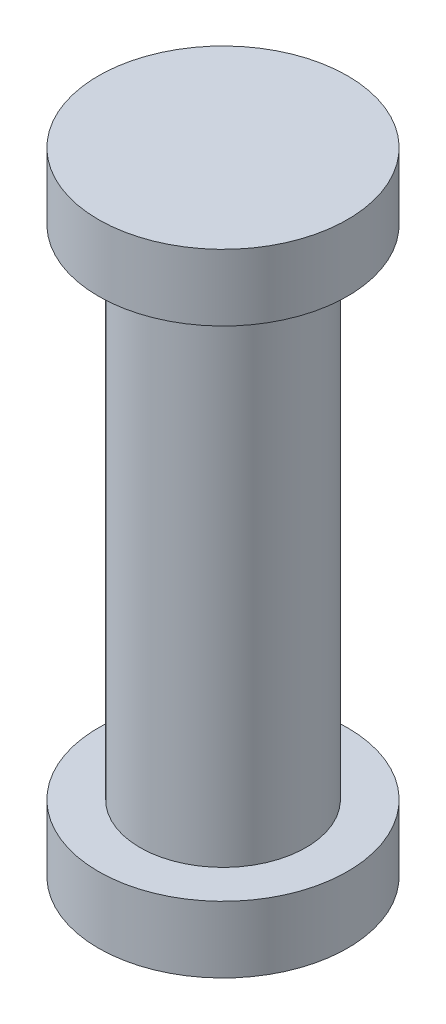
ISO-10303-21;
HEADER;
FILE_DESCRIPTION(('STEP AP214'),'2;1');
FILE_NAME('part.step','',(''),(''),'','','');
FILE_SCHEMA(('AUTOMOTIVE_DESIGN { 1 0 10303 214 1 1 1 1 }'));
ENDSEC;
DATA;
#1=APPLICATION_CONTEXT('core data for automotive mechanical design processes');
#2=APPLICATION_PROTOCOL_DEFINITION('international standard','automotive_design',2000,#1);
#3=PRODUCT_CONTEXT('',#1,'mechanical');
#4=PRODUCT('Part','Part','',(#3));
#5=PRODUCT_RELATED_PRODUCT_CATEGORY('part','',(#4));
#6=PRODUCT_DEFINITION_FORMATION('','',#4);
#7=PRODUCT_DEFINITION_CONTEXT('part definition',#1,'design');
#8=PRODUCT_DEFINITION('design','',#6,#7);
#9=PRODUCT_DEFINITION_SHAPE('','',#8);
#10=(LENGTH_UNIT() NAMED_UNIT(*) SI_UNIT(.MILLI.,.METRE.));
#11=(NAMED_UNIT(*) PLANE_ANGLE_UNIT() SI_UNIT($,.RADIAN.));
#12=(NAMED_UNIT(*) SI_UNIT($,.STERADIAN.) SOLID_ANGLE_UNIT());
#13=UNCERTAINTY_MEASURE_WITH_UNIT(LENGTH_MEASURE(1.E-05),#10,'distance_accuracy_value','');
#14=(GEOMETRIC_REPRESENTATION_CONTEXT(3) GLOBAL_UNCERTAINTY_ASSIGNED_CONTEXT((#13)) GLOBAL_UNIT_ASSIGNED_CONTEXT((#10,
#11,#12)) REPRESENTATION_CONTEXT('',''));
#15=CARTESIAN_POINT('',(0.,0.,0.));
#16=DIRECTION('',(0.,0.,1.));
#17=DIRECTION('',(1.,0.,0.));
#18=AXIS2_PLACEMENT_3D('',#15,#16,#17);
#19=CARTESIAN_POINT('',(0.,20.32,0.));
#20=DIRECTION('',(0.,-1.,0.));
#21=DIRECTION('',(0.,0.,-1.));
#22=AXIS2_PLACEMENT_3D('',#19,#20,#21);
#23=CYLINDRICAL_SURFACE('',#22,3.175);
#24=CARTESIAN_POINT('',(0.,0.,0.));
#25=DIRECTION('',(0.,-1.,0.));
#26=DIRECTION('',(0.,0.,-1.));
#27=AXIS2_PLACEMENT_3D('',#24,#25,#26);
#28=CIRCLE('',#27,3.175);
#29=CARTESIAN_POINT('',(0.,0.,-3.175));
#30=VERTEX_POINT('',#29);
#31=EDGE_CURVE('E39',#30,#30,#28,.T.);
#32=ORIENTED_EDGE('',*,*,#31,.F.);
#33=EDGE_LOOP('',(#32));
#34=FACE_BOUND('',#33,.T.);
#35=CARTESIAN_POINT('',(0.,19.05,0.));
#36=DIRECTION('',(0.,1.,0.));
#37=DIRECTION('',(0.,0.,1.));
#38=AXIS2_PLACEMENT_3D('',#35,#36,#37);
#39=CIRCLE('',#38,3.175);
#40=CARTESIAN_POINT('',(0.,19.05,3.175));
#41=VERTEX_POINT('',#40);
#42=EDGE_CURVE('E10',#41,#41,#39,.T.);
#43=ORIENTED_EDGE('',*,*,#42,.F.);
#44=EDGE_LOOP('',(#43));
#45=FACE_BOUND('',#44,.T.);
#46=ADVANCED_FACE('F33',(#34,#45),#23,.T.);
#47=CARTESIAN_POINT('',(0.,0.,0.));
#48=DIRECTION('',(0.,-1.,0.));
#49=DIRECTION('',(0.,0.,-1.));
#50=AXIS2_PLACEMENT_3D('',#47,#48,#49);
#51=PLANE('',#50);
#52=CARTESIAN_POINT('',(0.,0.,0.));
#53=DIRECTION('',(0.,-1.,0.));
#54=DIRECTION('',(0.,0.,-1.));
#55=AXIS2_PLACEMENT_3D('',#52,#53,#54);
#56=CIRCLE('',#55,4.7625);
#57=CARTESIAN_POINT('',(0.,0.,-4.7625));
#58=VERTEX_POINT('',#57);
#59=EDGE_CURVE('E47',#58,#58,#56,.T.);
#60=ORIENTED_EDGE('',*,*,#59,.F.);
#61=EDGE_LOOP('',(#60));
#62=FACE_BOUND('',#61,.T.);
#63=ORIENTED_EDGE('',*,*,#31,.T.);
#64=EDGE_LOOP('',(#63));
#65=FACE_BOUND('',#64,.T.);
#66=ADVANCED_FACE('F77',(#62,#65),#51,.F.);
#67=CARTESIAN_POINT('',(0.,-2.54,0.));
#68=DIRECTION('',(0.,1.,0.));
#69=DIRECTION('',(0.,0.,1.));
#70=AXIS2_PLACEMENT_3D('',#67,#68,#69);
#71=CYLINDRICAL_SURFACE('',#70,4.7625);
#72=CARTESIAN_POINT('',(0.,-2.54,0.));
#73=DIRECTION('',(0.,-1.,0.));
#74=DIRECTION('',(0.,0.,-1.));
#75=AXIS2_PLACEMENT_3D('',#72,#73,#74);
#76=CIRCLE('',#75,4.7625);
#77=CARTESIAN_POINT('',(0.,-2.54,-4.7625));
#78=VERTEX_POINT('',#77);
#79=EDGE_CURVE('E43',#78,#78,#76,.T.);
#80=ORIENTED_EDGE('',*,*,#79,.F.);
#81=EDGE_LOOP('',(#80));
#82=FACE_BOUND('',#81,.T.);
#83=ORIENTED_EDGE('',*,*,#59,.T.);
#84=EDGE_LOOP('',(#83));
#85=FACE_BOUND('',#84,.T.);
#86=ADVANCED_FACE('F72',(#82,#85),#71,.T.);
#87=CARTESIAN_POINT('',(0.,-2.54,0.));
#88=DIRECTION('',(0.,-1.,0.));
#89=DIRECTION('',(0.,0.,-1.));
#90=AXIS2_PLACEMENT_3D('',#87,#88,#89);
#91=PLANE('',#90);
#92=ORIENTED_EDGE('',*,*,#79,.T.);
#93=EDGE_LOOP('',(#92));
#94=FACE_BOUND('',#93,.T.);
#95=ADVANCED_FACE('F63',(#94),#91,.T.);
#96=CARTESIAN_POINT('',(0.,19.05,0.));
#97=DIRECTION('',(0.,1.,0.));
#98=DIRECTION('',(0.,0.,1.));
#99=AXIS2_PLACEMENT_3D('',#96,#97,#98);
#100=PLANE('',#99);
#101=CARTESIAN_POINT('',(0.,19.05,0.));
#102=DIRECTION('',(0.,1.,0.));
#103=DIRECTION('',(0.,0.,1.));
#104=AXIS2_PLACEMENT_3D('',#101,#102,#103);
#105=CIRCLE('',#104,4.7625);
#106=CARTESIAN_POINT('',(0.,19.05,4.7625));
#107=VERTEX_POINT('',#106);
#108=EDGE_CURVE('E55',#107,#107,#105,.T.);
#109=ORIENTED_EDGE('',*,*,#108,.F.);
#110=EDGE_LOOP('',(#109));
#111=FACE_BOUND('',#110,.T.);
#112=ORIENTED_EDGE('',*,*,#42,.T.);
#113=EDGE_LOOP('',(#112));
#114=FACE_BOUND('',#113,.T.);
#115=ADVANCED_FACE('F61',(#111,#114),#100,.F.);
#116=CARTESIAN_POINT('',(0.,21.59,0.));
#117=DIRECTION('',(0.,-1.,0.));
#118=DIRECTION('',(0.,0.,-1.));
#119=AXIS2_PLACEMENT_3D('',#116,#117,#118);
#120=CYLINDRICAL_SURFACE('',#119,4.7625);
#121=CARTESIAN_POINT('',(0.,21.59,0.));
#122=DIRECTION('',(0.,1.,0.));
#123=DIRECTION('',(0.,0.,1.));
#124=AXIS2_PLACEMENT_3D('',#121,#122,#123);
#125=CIRCLE('',#124,4.7625);
#126=CARTESIAN_POINT('',(0.,21.59,4.7625));
#127=VERTEX_POINT('',#126);
#128=EDGE_CURVE('E51',#127,#127,#125,.T.);
#129=ORIENTED_EDGE('',*,*,#128,.F.);
#130=EDGE_LOOP('',(#129));
#131=FACE_BOUND('',#130,.T.);
#132=ORIENTED_EDGE('',*,*,#108,.T.);
#133=EDGE_LOOP('',(#132));
#134=FACE_BOUND('',#133,.T.);
#135=ADVANCED_FACE('F59',(#131,#134),#120,.T.);
#136=CARTESIAN_POINT('',(0.,21.59,0.));
#137=DIRECTION('',(0.,1.,0.));
#138=DIRECTION('',(0.,0.,1.));
#139=AXIS2_PLACEMENT_3D('',#136,#137,#138);
#140=PLANE('',#139);
#141=ORIENTED_EDGE('',*,*,#128,.T.);
#142=EDGE_LOOP('',(#141));
#143=FACE_BOUND('',#142,.T.);
#144=ADVANCED_FACE('F69',(#143),#140,.T.);
#145=CLOSED_SHELL('',(#46,#66,#86,#95,#115,#135,#144));
#146=MANIFOLD_SOLID_BREP('B2',#145);
#147=ADVANCED_BREP_SHAPE_REPRESENTATION('',(#18,#146),#14);
#148=SHAPE_DEFINITION_REPRESENTATION(#9,#147);
ENDSEC;
END-ISO-10303-21;
